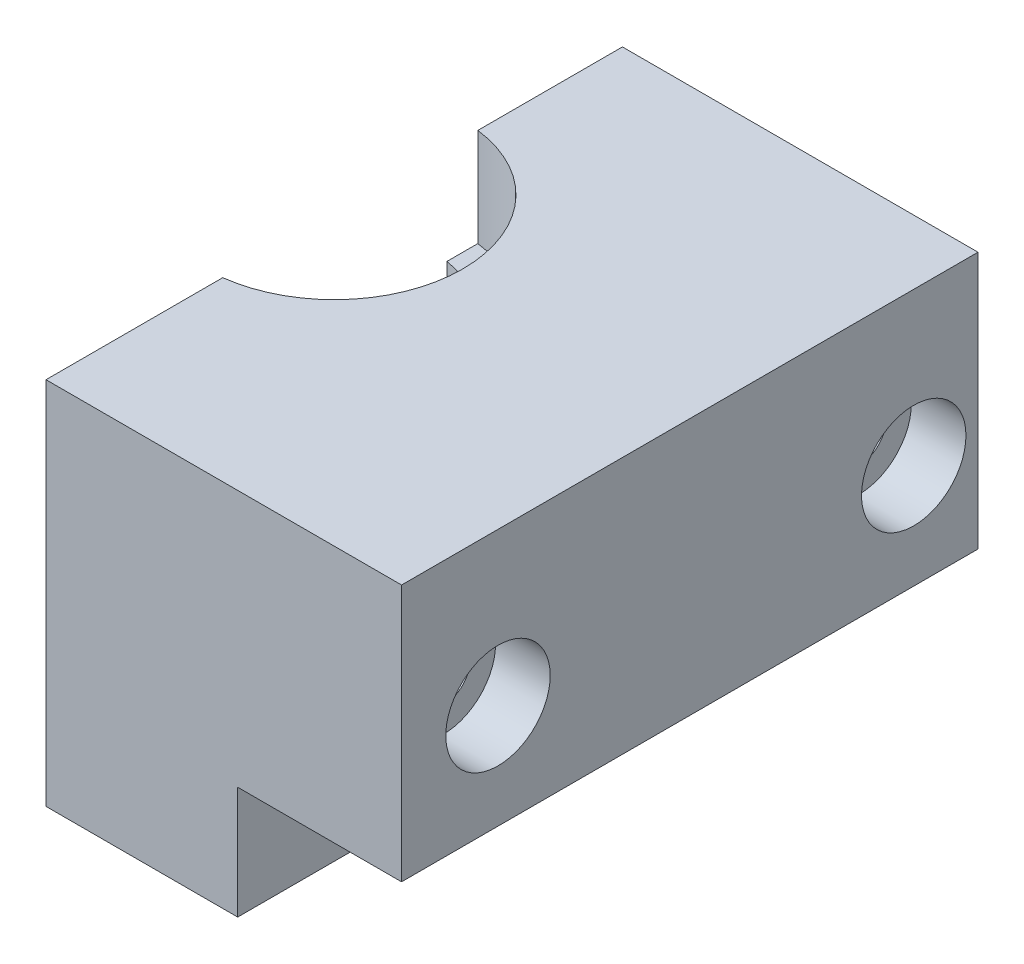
ISO-10303-21;
HEADER;
FILE_DESCRIPTION(('STEP AP214'),'2;1');
FILE_NAME('part.step','',(''),(''),'','','');
FILE_SCHEMA(('AUTOMOTIVE_DESIGN { 1 0 10303 214 1 1 1 1 }'));
ENDSEC;
DATA;
#1=APPLICATION_CONTEXT('core data for automotive mechanical design processes');
#2=APPLICATION_PROTOCOL_DEFINITION('international standard','automotive_design',2000,#1);
#3=PRODUCT_CONTEXT('',#1,'mechanical');
#4=PRODUCT('Part','Part','',(#3));
#5=PRODUCT_RELATED_PRODUCT_CATEGORY('part','',(#4));
#6=PRODUCT_DEFINITION_FORMATION('','',#4);
#7=PRODUCT_DEFINITION_CONTEXT('part definition',#1,'design');
#8=PRODUCT_DEFINITION('design','',#6,#7);
#9=PRODUCT_DEFINITION_SHAPE('','',#8);
#10=(LENGTH_UNIT() NAMED_UNIT(*) SI_UNIT(.MILLI.,.METRE.));
#11=(NAMED_UNIT(*) PLANE_ANGLE_UNIT() SI_UNIT($,.RADIAN.));
#12=(NAMED_UNIT(*) SI_UNIT($,.STERADIAN.) SOLID_ANGLE_UNIT());
#13=UNCERTAINTY_MEASURE_WITH_UNIT(LENGTH_MEASURE(1.E-05),#10,'distance_accuracy_value','');
#14=(GEOMETRIC_REPRESENTATION_CONTEXT(3) GLOBAL_UNCERTAINTY_ASSIGNED_CONTEXT((#13)) GLOBAL_UNIT_ASSIGNED_CONTEXT((#10,
#11,#12)) REPRESENTATION_CONTEXT('',''));
#15=CARTESIAN_POINT('',(0.,0.,0.));
#16=DIRECTION('',(0.,0.,1.));
#17=DIRECTION('',(1.,0.,0.));
#18=AXIS2_PLACEMENT_3D('',#15,#16,#17);
#19=CARTESIAN_POINT('',(-12.065,-11.5,0.));
#20=DIRECTION('',(0.,1.,0.));
#21=DIRECTION('',(0.,0.,1.));
#22=AXIS2_PLACEMENT_3D('',#19,#20,#21);
#23=CYLINDRICAL_SURFACE('',#22,8.);
#24=CARTESIAN_POINT('',(-12.065,-7.5,0.));
#25=DIRECTION('',(0.,-1.,0.));
#26=DIRECTION('',(0.,0.,-1.));
#27=AXIS2_PLACEMENT_3D('',#24,#25,#26);
#28=CIRCLE('',#27,8.);
#29=CARTESIAN_POINT('',(-11.065,-7.5,7.93725393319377));
#30=VERTEX_POINT('',#29);
#31=CARTESIAN_POINT('',(-4.87125271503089,-7.49999999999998,3.50000000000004));
#32=VERTEX_POINT('',#31);
#33=EDGE_CURVE('E68',#30,#32,#28,.F.);
#34=ORIENTED_EDGE('',*,*,#33,.F.);
#35=DIRECTION('',(0.,1.,0.));
#36=VECTOR('',#35,1.);
#37=CARTESIAN_POINT('',(-11.065,-11.5,7.93725393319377));
#38=LINE('',#37,#36);
#39=CARTESIAN_POINT('',(-11.065,-0.299999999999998,7.93725393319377));
#40=VERTEX_POINT('',#39);
#41=EDGE_CURVE('E299',#30,#40,#38,.T.);
#42=ORIENTED_EDGE('',*,*,#41,.T.);
#43=CARTESIAN_POINT('',(-12.065,-0.299999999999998,0.));
#44=DIRECTION('',(0.,-1.,0.));
#45=DIRECTION('',(0.,0.,-1.));
#46=AXIS2_PLACEMENT_3D('',#43,#44,#45);
#47=CIRCLE('',#46,8.);
#48=CARTESIAN_POINT('',(-11.065,-0.299999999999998,-7.93725393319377));
#49=VERTEX_POINT('',#48);
#50=EDGE_CURVE('E344',#49,#40,#47,.T.);
#51=ORIENTED_EDGE('',*,*,#50,.F.);
#52=DIRECTION('',(0.,1.,0.));
#53=VECTOR('',#52,1.);
#54=CARTESIAN_POINT('',(-11.065,-11.5,-7.93725393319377));
#55=LINE('',#54,#53);
#56=CARTESIAN_POINT('',(-11.065,-7.5,-7.93725393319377));
#57=VERTEX_POINT('',#56);
#58=EDGE_CURVE('E291',#49,#57,#55,.F.);
#59=ORIENTED_EDGE('',*,*,#58,.T.);
#60=CARTESIAN_POINT('',(-4.87125271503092,-7.5,-3.50000000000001));
#61=VERTEX_POINT('',#60);
#62=EDGE_CURVE('E225',#61,#57,#28,.F.);
#63=ORIENTED_EDGE('',*,*,#62,.F.);
#64=CARTESIAN_POINT('',(-11.065,-9.84339604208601,-7.93725393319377));
#65=CARTESIAN_POINT('',(-10.8516968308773,-9.82138564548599,-7.91041827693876));
#66=CARTESIAN_POINT('',(-10.6403327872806,-9.79242767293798,-7.87501934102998));
#67=CARTESIAN_POINT('',(-10.2233320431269,-9.72247689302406,-7.7880281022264));
#68=CARTESIAN_POINT('',(-10.0176868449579,-9.68150311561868,-7.73646139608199));
#69=CARTESIAN_POINT('',(-9.61485748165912,-9.58965739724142,-7.61843665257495));
#70=CARTESIAN_POINT('',(-9.41762011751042,-9.53886458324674,-7.55209705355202));
#71=CARTESIAN_POINT('',(-9.03080584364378,-9.42915389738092,-7.405165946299));
#72=CARTESIAN_POINT('',(-8.84123203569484,-9.37023277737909,-7.32456873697));
#73=CARTESIAN_POINT('',(-8.471625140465,-9.24660173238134,-7.15046374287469));
#74=CARTESIAN_POINT('',(-8.29154095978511,-9.1819292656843,-7.05703761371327));
#75=CARTESIAN_POINT('',(-7.94023110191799,-9.04833302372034,-6.85763074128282));
#76=CARTESIAN_POINT('',(-7.76900439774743,-8.97940974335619,-6.75165145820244));
#77=CARTESIAN_POINT('',(-7.26812732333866,-8.76836706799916,-6.41498828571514));
#78=CARTESIAN_POINT('',(-6.95211116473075,-8.62226701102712,-6.1659736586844));
#79=CARTESIAN_POINT('',(-6.48584256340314,-8.39346998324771,-5.73817827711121));
#80=CARTESIAN_POINT('',(-6.32198158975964,-8.31007433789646,-5.57419621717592));
#81=CARTESIAN_POINT('',(-6.00842897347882,-8.14596170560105,-5.23180624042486));
#82=CARTESIAN_POINT('',(-5.85873913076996,-8.06524505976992,-5.05339649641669));
#83=CARTESIAN_POINT('',(-5.57476999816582,-7.90866364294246,-4.68308744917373));
#84=CARTESIAN_POINT('',(-5.44047309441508,-7.83279337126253,-4.49120397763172));
#85=CARTESIAN_POINT('',(-5.18825411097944,-7.68776099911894,-4.09457688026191));
#86=CARTESIAN_POINT('',(-5.07032847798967,-7.61859744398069,-3.88983605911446));
#87=CARTESIAN_POINT('',(-4.87047206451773,-7.49975351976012,-3.50395881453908));
#88=CARTESIAN_POINT('',(-4.78582230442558,-7.44875186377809,-3.32463324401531));
#89=CARTESIAN_POINT('',(-4.62953717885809,-7.35371426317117,-2.95862661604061));
#90=CARTESIAN_POINT('',(-4.55789957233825,-7.30967711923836,-2.77194683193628));
#91=CARTESIAN_POINT('',(-4.42843387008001,-7.22952492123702,-2.39229204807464));
#92=CARTESIAN_POINT('',(-4.37059938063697,-7.19340619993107,-2.19932001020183));
#93=CARTESIAN_POINT('',(-4.26940955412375,-7.12988771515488,-1.80819503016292));
#94=CARTESIAN_POINT('',(-4.22605439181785,-7.10248805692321,-1.6100420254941));
#95=CARTESIAN_POINT('',(-4.15426372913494,-7.05697090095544,-1.20909285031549));
#96=CARTESIAN_POINT('',(-4.12589362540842,-7.03889409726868,-1.00628029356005));
#97=CARTESIAN_POINT('',(-4.08478184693,-7.01266119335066,-0.598433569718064));
#98=CARTESIAN_POINT('',(-4.07204020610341,-7.00450511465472,-0.393399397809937));
#99=CARTESIAN_POINT('',(-4.06238369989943,-6.99832595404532,0.0171741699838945));
#100=CARTESIAN_POINT('',(-4.06546727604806,-7.00030187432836,0.22271351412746));
#101=CARTESIAN_POINT('',(-4.08741001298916,-7.01433340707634,0.632593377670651));
#102=CARTESIAN_POINT('',(-4.10626844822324,-7.02638855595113,0.836933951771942));
#103=CARTESIAN_POINT('',(-4.15754171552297,-7.05903785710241,1.2280690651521));
#104=CARTESIAN_POINT('',(-4.18887741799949,-7.07895135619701,1.41506372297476));
#105=CARTESIAN_POINT('',(-4.26449124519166,-7.12675958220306,1.78544091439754));
#106=CARTESIAN_POINT('',(-4.3087737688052,-7.1546570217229,1.96882219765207));
#107=CARTESIAN_POINT('',(-4.40974986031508,-7.21784607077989,2.33075872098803));
#108=CARTESIAN_POINT('',(-4.46643970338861,-7.2531354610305,2.5093153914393));
#109=CARTESIAN_POINT('',(-4.59166685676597,-7.33043621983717,2.86078964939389));
#110=CARTESIAN_POINT('',(-4.66020871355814,-7.37245016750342,3.03370504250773));
#111=CARTESIAN_POINT('',(-4.81250630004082,-7.46485146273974,3.38222010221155));
#112=CARTESIAN_POINT('',(-4.8968833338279,-7.51556827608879,3.55746126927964));
#113=CARTESIAN_POINT('',(-5.07734653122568,-7.62262483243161,3.90002972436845));
#114=CARTESIAN_POINT('',(-5.17343697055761,-7.67896662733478,4.06735409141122));
#115=CARTESIAN_POINT('',(-5.47828963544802,-7.85495527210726,4.55661815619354));
#116=CARTESIAN_POINT('',(-5.70368782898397,-7.98159930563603,4.86597252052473));
#117=CARTESIAN_POINT('',(-6.08900302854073,-8.1885655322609,5.3230775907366));
#118=CARTESIAN_POINT('',(-6.23597017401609,-8.26566693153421,5.48357898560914));
#119=CARTESIAN_POINT('',(-6.54211922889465,-8.42142482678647,5.79179798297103));
#120=CARTESIAN_POINT('',(-6.70130266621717,-8.50008151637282,5.93951398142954));
#121=CARTESIAN_POINT('',(-7.03136555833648,-8.65719639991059,6.22171507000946));
#122=CARTESIAN_POINT('',(-7.20225624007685,-8.73565432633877,6.3561871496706));
#123=CARTESIAN_POINT('',(-7.55507178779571,-8.89036663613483,6.61119578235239));
#124=CARTESIAN_POINT('',(-7.73699552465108,-8.96662124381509,6.73173375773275));
#125=CARTESIAN_POINT('',(-8.09648191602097,-9.10894092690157,6.94920247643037));
#126=CARTESIAN_POINT('',(-8.27324003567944,-9.17533400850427,7.04724842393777));
#127=CARTESIAN_POINT('',(-8.63527823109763,-9.30273142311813,7.2303634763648));
#128=CARTESIAN_POINT('',(-8.82055928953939,-9.36373513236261,7.31543107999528));
#129=CARTESIAN_POINT('',(-9.19843098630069,-9.47827787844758,7.47157539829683));
#130=CARTESIAN_POINT('',(-9.39099646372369,-9.53184007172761,7.54269581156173));
#131=CARTESIAN_POINT('',(-9.78306774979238,-9.62978047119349,7.670413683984));
#132=CARTESIAN_POINT('',(-9.98256906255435,-9.67416450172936,7.7270203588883));
#133=CARTESIAN_POINT('',(-10.3290238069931,-9.74071506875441,7.81078422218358));
#134=CARTESIAN_POINT('',(-10.4745496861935,-9.76559810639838,7.8417269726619));
#135=CARTESIAN_POINT('',(-10.7680765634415,-9.80923967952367,7.89558769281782));
#136=CARTESIAN_POINT('',(-10.9160790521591,-9.82799437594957,7.91850063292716));
#137=CARTESIAN_POINT('',(-11.065,-9.84339604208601,7.93725393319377));
#138=B_SPLINE_CURVE_WITH_KNOTS('',3,(#64,#65,#66,#67,#68,#69,#70,#71,#72,#73,#74,#75,#76,#77,
#78,#79,#80,#81,#82,#83,#84,#85,#86,#87,#88,#89,#90,#91,#92,#93,#94,#95,#96,#97,#98,#99,#100,
#101,#102,#103,#104,#105,#106,#107,#108,#109,#110,#111,#112,#113,#114,#115,#116,#117,#118,#119,
#120,#121,#122,#123,#124,#125,#126,#127,#128,#129,#130,#131,#132,#133,#134,#135,#136,#137),
.UNSPECIFIED.,.F.,.F.,(4,2,2,2,2,2,2,2,2,2,2,2,2,2,2,2,2,2,2,2,2,2,2,2,2,2,2,2,2,2,2,2,2,2,2,2,
4),(0.,0.647832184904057,1.29464385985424,1.93644549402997,2.57850434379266,3.2166511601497,
3.85472381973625,5.1337389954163,5.87217106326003,6.61069679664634,7.34836882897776,
8.0858805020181,8.69952634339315,9.31306639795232,9.92632170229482,10.5395844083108,
11.1555018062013,11.7714205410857,12.3872786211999,13.0031083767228,13.5743976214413,
14.1458811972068,14.7171934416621,15.2887253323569,15.8910923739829,16.4936799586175,
17.6984408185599,18.3905405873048,19.0827270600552,19.7755868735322,20.4683758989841,
21.1060476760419,21.7437931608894,22.3795073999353,23.0148169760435,23.4670158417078,
23.9194974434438),.UNSPECIFIED.);
#139=EDGE_CURVE('E243',#61,#32,#138,.T.);
#140=ORIENTED_EDGE('',*,*,#139,.T.);
#141=EDGE_LOOP('',(#34,#42,#51,#59,#63,#140));
#142=FACE_BOUND('',#141,.T.);
#143=ADVANCED_FACE('F38',(#142),#23,.F.);
#144=CARTESIAN_POINT('',(11.065,-11.5,17.9375));
#145=DIRECTION('',(0.,1.,0.));
#146=DIRECTION('',(0.,0.,1.));
#147=AXIS2_PLACEMENT_3D('',#144,#145,#146);
#148=PLANE('',#147);
#149=DIRECTION('',(0.,0.,-1.));
#150=VECTOR('',#149,1.);
#151=CARTESIAN_POINT('',(-11.065,-11.5,17.9375));
#152=LINE('',#151,#150);
#153=CARTESIAN_POINT('',(-11.065,-11.5,18.9375));
#154=VERTEX_POINT('',#153);
#155=CARTESIAN_POINT('',(-11.065,-11.5,11.4564392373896));
#156=VERTEX_POINT('',#155);
#157=EDGE_CURVE('E309',#154,#156,#152,.T.);
#158=ORIENTED_EDGE('',*,*,#157,.T.);
#159=CARTESIAN_POINT('',(-12.065,-11.5,0.));
#160=DIRECTION('',(0.,-1.,0.));
#161=DIRECTION('',(0.,0.,-1.));
#162=AXIS2_PLACEMENT_3D('',#159,#160,#161);
#163=CIRCLE('',#162,11.5);
#164=CARTESIAN_POINT('',(-5.74044467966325,-11.5,9.60468635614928));
#165=VERTEX_POINT('',#164);
#166=EDGE_CURVE('E215',#165,#156,#163,.T.);
#167=ORIENTED_EDGE('',*,*,#166,.F.);
#168=DIRECTION('',(1.,0.,0.));
#169=VECTOR('',#168,1.);
#170=CARTESIAN_POINT('',(-11.065,-11.5,9.60468635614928));
#171=LINE('',#170,#169);
#172=CARTESIAN_POINT('',(0.865000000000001,-11.5,9.60468635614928));
#173=VERTEX_POINT('',#172);
#174=EDGE_CURVE('E431',#165,#173,#171,.T.);
#175=ORIENTED_EDGE('',*,*,#174,.T.);
#176=DIRECTION('',(0.,0.,-1.));
#177=VECTOR('',#176,1.);
#178=CARTESIAN_POINT('',(0.865000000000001,-11.5,17.9375));
#179=LINE('',#178,#177);
#180=CARTESIAN_POINT('',(0.865000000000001,-11.5,18.9375));
#181=VERTEX_POINT('',#180);
#182=EDGE_CURVE('E183',#181,#173,#179,.T.);
#183=ORIENTED_EDGE('',*,*,#182,.F.);
#184=DIRECTION('',(1.,0.,0.));
#185=VECTOR('',#184,1.);
#186=CARTESIAN_POINT('',(-11.065,-11.5,18.9375));
#187=LINE('',#186,#185);
#188=EDGE_CURVE('E199',#154,#181,#187,.T.);
#189=ORIENTED_EDGE('',*,*,#188,.F.);
#190=EDGE_LOOP('',(#158,#167,#175,#183,#189));
#191=FACE_BOUND('',#190,.T.);
#192=ADVANCED_FACE('F445',(#191),#148,.F.);
#193=CARTESIAN_POINT('',(11.065,0.,0.));
#194=DIRECTION('',(-1.,0.,0.));
#195=DIRECTION('',(0.,0.,1.));
#196=AXIS2_PLACEMENT_3D('',#193,#194,#195);
#197=PLANE('',#196);
#198=CARTESIAN_POINT('',(11.065,2.,12.9375));
#199=DIRECTION('',(1.,0.,0.));
#200=DIRECTION('',(0.,0.,-1.));
#201=AXIS2_PLACEMENT_3D('',#198,#199,#200);
#202=CIRCLE('',#201,3.25);
#203=CARTESIAN_POINT('',(11.065,2.,9.68750000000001));
#204=VERTEX_POINT('',#203);
#205=EDGE_CURVE('E428',#204,#204,#202,.T.);
#206=ORIENTED_EDGE('',*,*,#205,.F.);
#207=EDGE_LOOP('',(#206));
#208=FACE_BOUND('',#207,.T.);
#209=CARTESIAN_POINT('',(11.065,2.,-12.9375));
#210=DIRECTION('',(1.,0.,0.));
#211=DIRECTION('',(0.,0.,-1.));
#212=AXIS2_PLACEMENT_3D('',#209,#210,#211);
#213=CIRCLE('',#212,3.25);
#214=CARTESIAN_POINT('',(11.065,2.,-16.1875));
#215=VERTEX_POINT('',#214);
#216=EDGE_CURVE('E412',#215,#215,#213,.T.);
#217=ORIENTED_EDGE('',*,*,#216,.F.);
#218=EDGE_LOOP('',(#217));
#219=FACE_BOUND('',#218,.T.);
#220=DIRECTION('',(0.,0.,1.));
#221=VECTOR('',#220,1.);
#222=CARTESIAN_POINT('',(11.065,11.5,17.9375));
#223=LINE('',#222,#221);
#224=CARTESIAN_POINT('',(11.065,11.5,-16.9375));
#225=VERTEX_POINT('',#224);
#226=CARTESIAN_POINT('',(11.065,11.5,18.9375));
#227=VERTEX_POINT('',#226);
#228=EDGE_CURVE('E313',#225,#227,#223,.T.);
#229=ORIENTED_EDGE('',*,*,#228,.T.);
#230=DIRECTION('',(0.,1.,0.));
#231=VECTOR('',#230,1.);
#232=CARTESIAN_POINT('',(11.065,-4.5,18.9375));
#233=LINE('',#232,#231);
#234=CARTESIAN_POINT('',(11.065,-4.5,18.9375));
#235=VERTEX_POINT('',#234);
#236=EDGE_CURVE('E193',#235,#227,#233,.T.);
#237=ORIENTED_EDGE('',*,*,#236,.F.);
#238=DIRECTION('',(0.,0.,1.));
#239=VECTOR('',#238,1.);
#240=CARTESIAN_POINT('',(11.065,-4.5,17.9375));
#241=LINE('',#240,#239);
#242=CARTESIAN_POINT('',(11.065,-4.5,-16.9375));
#243=VERTEX_POINT('',#242);
#244=EDGE_CURVE('E182',#243,#235,#241,.T.);
#245=ORIENTED_EDGE('',*,*,#244,.F.);
#246=DIRECTION('',(0.,-1.,0.));
#247=VECTOR('',#246,1.);
#248=CARTESIAN_POINT('',(11.065,11.5,-16.9375));
#249=LINE('',#248,#247);
#250=EDGE_CURVE('E394',#225,#243,#249,.T.);
#251=ORIENTED_EDGE('',*,*,#250,.F.);
#252=EDGE_LOOP('',(#229,#237,#245,#251));
#253=FACE_BOUND('',#252,.T.);
#254=ADVANCED_FACE('F535',(#208,#219,#253),#197,.F.);
#255=CARTESIAN_POINT('',(-12.065,5.4,0.));
#256=DIRECTION('',(0.,-1.,0.));
#257=DIRECTION('',(0.,0.,-1.));
#258=AXIS2_PLACEMENT_3D('',#255,#256,#257);
#259=CIRCLE('',#258,8.);
#260=CARTESIAN_POINT('',(-11.065,5.4,-7.93725393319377));
#261=VERTEX_POINT('',#260);
#262=CARTESIAN_POINT('',(-11.065,5.4,7.93725393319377));
#263=VERTEX_POINT('',#262);
#264=EDGE_CURVE('E335',#261,#263,#259,.T.);
#265=ORIENTED_EDGE('',*,*,#264,.T.);
#266=CARTESIAN_POINT('',(-11.065,11.5,7.93725393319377));
#267=VERTEX_POINT('',#266);
#268=EDGE_CURVE('E302',#263,#267,#38,.T.);
#269=ORIENTED_EDGE('',*,*,#268,.T.);
#270=CARTESIAN_POINT('',(-12.065,11.5,0.));
#271=DIRECTION('',(0.,1.,0.));
#272=DIRECTION('',(0.,0.,1.));
#273=AXIS2_PLACEMENT_3D('',#270,#271,#272);
#274=CIRCLE('',#273,8.);
#275=CARTESIAN_POINT('',(-11.065,11.5,-7.93725393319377));
#276=VERTEX_POINT('',#275);
#277=EDGE_CURVE('E321',#267,#276,#274,.T.);
#278=ORIENTED_EDGE('',*,*,#277,.T.);
#279=EDGE_CURVE('E305',#276,#261,#55,.F.);
#280=ORIENTED_EDGE('',*,*,#279,.T.);
#281=EDGE_LOOP('',(#265,#269,#278,#280));
#282=FACE_BOUND('',#281,.T.);
#283=ADVANCED_FACE('F505',(#282),#23,.F.);
#284=CARTESIAN_POINT('',(-11.065,0.,0.));
#285=DIRECTION('',(-1.,0.,0.));
#286=DIRECTION('',(0.,0.,1.));
#287=AXIS2_PLACEMENT_3D('',#284,#285,#286);
#288=PLANE('',#287);
#289=DIRECTION('',(0.,-1.,0.));
#290=VECTOR('',#289,1.);
#291=CARTESIAN_POINT('',(-11.065,-7.5,11.4564392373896));
#292=LINE('',#291,#290);
#293=CARTESIAN_POINT('',(-11.065,-7.5,11.4564392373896));
#294=VERTEX_POINT('',#293);
#295=EDGE_CURVE('E236',#156,#294,#292,.F.);
#296=ORIENTED_EDGE('',*,*,#295,.F.);
#297=ORIENTED_EDGE('',*,*,#157,.F.);
#298=DIRECTION('',(0.,-1.,0.));
#299=VECTOR('',#298,1.);
#300=CARTESIAN_POINT('',(-11.065,11.5,18.9375));
#301=LINE('',#300,#299);
#302=CARTESIAN_POINT('',(-11.065,11.5,18.9375));
#303=VERTEX_POINT('',#302);
#304=EDGE_CURVE('E210',#303,#154,#301,.T.);
#305=ORIENTED_EDGE('',*,*,#304,.F.);
#306=DIRECTION('',(0.,0.,1.));
#307=VECTOR('',#306,1.);
#308=CARTESIAN_POINT('',(-11.065,11.5,17.9375));
#309=LINE('',#308,#307);
#310=EDGE_CURVE('E318',#267,#303,#309,.T.);
#311=ORIENTED_EDGE('',*,*,#310,.F.);
#312=ORIENTED_EDGE('',*,*,#268,.F.);
#313=DIRECTION('',(0.,0.,-1.));
#314=VECTOR('',#313,1.);
#315=CARTESIAN_POINT('',(-11.065,5.4,7.93725393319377));
#316=LINE('',#315,#314);
#317=CARTESIAN_POINT('',(-11.065,5.4,6.01747455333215));
#318=VERTEX_POINT('',#317);
#319=EDGE_CURVE('E355',#263,#318,#316,.T.);
#320=ORIENTED_EDGE('',*,*,#319,.T.);
#321=DIRECTION('',(0.,-1.,0.));
#322=VECTOR('',#321,1.);
#323=CARTESIAN_POINT('',(-11.065,5.4,6.01747455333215));
#324=LINE('',#323,#322);
#325=CARTESIAN_POINT('',(-11.065,-0.299999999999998,6.01747455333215));
#326=VERTEX_POINT('',#325);
#327=EDGE_CURVE('E326',#318,#326,#324,.T.);
#328=ORIENTED_EDGE('',*,*,#327,.T.);
#329=DIRECTION('',(0.,0.,-1.));
#330=VECTOR('',#329,1.);
#331=CARTESIAN_POINT('',(-11.065,-0.299999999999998,7.93725393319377));
#332=LINE('',#331,#330);
#333=EDGE_CURVE('E340',#40,#326,#332,.T.);
#334=ORIENTED_EDGE('',*,*,#333,.F.);
#335=ORIENTED_EDGE('',*,*,#41,.F.);
#336=DIRECTION('',(0.,0.,1.));
#337=VECTOR('',#336,1.);
#338=CARTESIAN_POINT('',(-11.065,-7.5,0.));
#339=LINE('',#338,#337);
#340=EDGE_CURVE('E224',#30,#294,#339,.T.);
#341=ORIENTED_EDGE('',*,*,#340,.T.);
#342=EDGE_LOOP('',(#296,#297,#305,#311,#312,#320,#328,#334,#335,#341));
#343=FACE_BOUND('',#342,.T.);
#344=CARTESIAN_POINT('',(-11.065,2.,12.9375));
#345=DIRECTION('',(1.,0.,0.));
#346=DIRECTION('',(0.,0.,-1.));
#347=AXIS2_PLACEMENT_3D('',#344,#345,#346);
#348=CIRCLE('',#347,1.69999999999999);
#349=CARTESIAN_POINT('',(-11.065,2.,11.2375));
#350=VERTEX_POINT('',#349);
#351=EDGE_CURVE('E416',#350,#350,#348,.T.);
#352=ORIENTED_EDGE('',*,*,#351,.T.);
#353=EDGE_LOOP('',(#352));
#354=FACE_BOUND('',#353,.T.);
#355=ADVANCED_FACE('F449',(#343,#354),#288,.T.);
#356=CARTESIAN_POINT('',(11.065,11.5,17.9375));
#357=DIRECTION('',(0.,-1.,0.));
#358=DIRECTION('',(0.,0.,-1.));
#359=AXIS2_PLACEMENT_3D('',#356,#357,#358);
#360=PLANE('',#359);
#361=ORIENTED_EDGE('',*,*,#310,.T.);
#362=DIRECTION('',(-1.,0.,0.));
#363=VECTOR('',#362,1.);
#364=CARTESIAN_POINT('',(11.065,11.5,18.9375));
#365=LINE('',#364,#363);
#366=EDGE_CURVE('E206',#227,#303,#365,.T.);
#367=ORIENTED_EDGE('',*,*,#366,.F.);
#368=ORIENTED_EDGE('',*,*,#228,.F.);
#369=DIRECTION('',(1.,0.,0.));
#370=VECTOR('',#369,1.);
#371=CARTESIAN_POINT('',(-11.065,11.5,-16.9375));
#372=LINE('',#371,#370);
#373=CARTESIAN_POINT('',(-11.065,11.5,-16.9375));
#374=VERTEX_POINT('',#373);
#375=EDGE_CURVE('E387',#374,#225,#372,.T.);
#376=ORIENTED_EDGE('',*,*,#375,.F.);
#377=EDGE_CURVE('E315',#374,#276,#309,.T.);
#378=ORIENTED_EDGE('',*,*,#377,.T.);
#379=ORIENTED_EDGE('',*,*,#277,.F.);
#380=EDGE_LOOP('',(#361,#367,#368,#376,#378,#379));
#381=FACE_BOUND('',#380,.T.);
#382=ADVANCED_FACE('F40',(#381),#360,.F.);
#383=DIRECTION('',(1.,0.,0.));
#384=VECTOR('',#383,1.);
#385=CARTESIAN_POINT('',(-11.065,-11.5,-9.60468635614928));
#386=LINE('',#385,#384);
#387=CARTESIAN_POINT('',(0.865000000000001,-11.5,-9.60468635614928));
#388=VERTEX_POINT('',#387);
#389=CARTESIAN_POINT('',(-5.74044467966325,-11.5,-9.60468635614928));
#390=VERTEX_POINT('',#389);
#391=EDGE_CURVE('E252',#388,#390,#386,.F.);
#392=ORIENTED_EDGE('',*,*,#391,.T.);
#393=CARTESIAN_POINT('',(-11.065,-11.5,-11.4564392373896));
#394=VERTEX_POINT('',#393);
#395=EDGE_CURVE('E219',#394,#390,#163,.T.);
#396=ORIENTED_EDGE('',*,*,#395,.F.);
#397=CARTESIAN_POINT('',(-11.065,-11.5,-16.9375));
#398=VERTEX_POINT('',#397);
#399=EDGE_CURVE('E314',#394,#398,#152,.T.);
#400=ORIENTED_EDGE('',*,*,#399,.T.);
#401=DIRECTION('',(1.,0.,0.));
#402=VECTOR('',#401,1.);
#403=CARTESIAN_POINT('',(-11.065,-11.5,-16.9375));
#404=LINE('',#403,#402);
#405=CARTESIAN_POINT('',(0.865000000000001,-11.5,-16.9375));
#406=VERTEX_POINT('',#405);
#407=EDGE_CURVE('E386',#398,#406,#404,.T.);
#408=ORIENTED_EDGE('',*,*,#407,.T.);
#409=EDGE_CURVE('E364',#388,#406,#179,.T.);
#410=ORIENTED_EDGE('',*,*,#409,.F.);
#411=EDGE_LOOP('',(#392,#396,#400,#408,#410));
#412=FACE_BOUND('',#411,.T.);
#413=ADVANCED_FACE('F442',(#412),#148,.F.);
#414=DIRECTION('',(0.,-1.,0.));
#415=VECTOR('',#414,1.);
#416=CARTESIAN_POINT('',(-11.065,-7.5,-11.4564392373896));
#417=LINE('',#416,#415);
#418=CARTESIAN_POINT('',(-11.065,-7.5,-11.4564392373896));
#419=VERTEX_POINT('',#418);
#420=EDGE_CURVE('E233',#419,#394,#417,.T.);
#421=ORIENTED_EDGE('',*,*,#420,.F.);
#422=DIRECTION('',(0.,0.,1.));
#423=VECTOR('',#422,1.);
#424=CARTESIAN_POINT('',(-11.065,-7.5,0.));
#425=LINE('',#424,#423);
#426=EDGE_CURVE('E229',#419,#57,#425,.T.);
#427=ORIENTED_EDGE('',*,*,#426,.T.);
#428=ORIENTED_EDGE('',*,*,#58,.F.);
#429=DIRECTION('',(0.,0.,-1.));
#430=VECTOR('',#429,1.);
#431=CARTESIAN_POINT('',(-11.065,-0.299999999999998,-6.01747455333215));
#432=LINE('',#431,#430);
#433=CARTESIAN_POINT('',(-11.065,-0.299999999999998,-6.01747455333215));
#434=VERTEX_POINT('',#433);
#435=EDGE_CURVE('E332',#434,#49,#432,.T.);
#436=ORIENTED_EDGE('',*,*,#435,.F.);
#437=DIRECTION('',(0.,-1.,0.));
#438=VECTOR('',#437,1.);
#439=CARTESIAN_POINT('',(-11.065,5.4,-6.01747455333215));
#440=LINE('',#439,#438);
#441=CARTESIAN_POINT('',(-11.065,5.4,-6.01747455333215));
#442=VERTEX_POINT('',#441);
#443=EDGE_CURVE('E325',#442,#434,#440,.T.);
#444=ORIENTED_EDGE('',*,*,#443,.F.);
#445=DIRECTION('',(0.,0.,-1.));
#446=VECTOR('',#445,1.);
#447=CARTESIAN_POINT('',(-11.065,5.4,-6.01747455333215));
#448=LINE('',#447,#446);
#449=EDGE_CURVE('E329',#442,#261,#448,.T.);
#450=ORIENTED_EDGE('',*,*,#449,.T.);
#451=ORIENTED_EDGE('',*,*,#279,.F.);
#452=ORIENTED_EDGE('',*,*,#377,.F.);
#453=DIRECTION('',(0.,-1.,0.));
#454=VECTOR('',#453,1.);
#455=CARTESIAN_POINT('',(-11.065,11.5,-16.9375));
#456=LINE('',#455,#454);
#457=EDGE_CURVE('E390',#374,#398,#456,.T.);
#458=ORIENTED_EDGE('',*,*,#457,.T.);
#459=ORIENTED_EDGE('',*,*,#399,.F.);
#460=EDGE_LOOP('',(#421,#427,#428,#436,#444,#450,#451,#452,#458,#459));
#461=FACE_BOUND('',#460,.T.);
#462=CARTESIAN_POINT('',(-11.065,2.,-12.9375));
#463=DIRECTION('',(1.,0.,0.));
#464=DIRECTION('',(0.,0.,-1.));
#465=AXIS2_PLACEMENT_3D('',#462,#463,#464);
#466=CIRCLE('',#465,1.69999999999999);
#467=CARTESIAN_POINT('',(-11.065,2.,-14.6375));
#468=VERTEX_POINT('',#467);
#469=EDGE_CURVE('E397',#468,#468,#466,.T.);
#470=ORIENTED_EDGE('',*,*,#469,.T.);
#471=EDGE_LOOP('',(#470));
#472=FACE_BOUND('',#471,.T.);
#473=ADVANCED_FACE('F521',(#461,#472),#288,.T.);
#474=CARTESIAN_POINT('',(-12.065,5.4,0.));
#475=DIRECTION('',(0.,-1.,0.));
#476=DIRECTION('',(0.,0.,-1.));
#477=AXIS2_PLACEMENT_3D('',#474,#475,#476);
#478=CYLINDRICAL_SURFACE('',#477,6.1);
#479=CARTESIAN_POINT('',(-12.065,-0.299999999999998,0.));
#480=DIRECTION('',(0.,1.,0.));
#481=DIRECTION('',(0.,0.,-1.));
#482=AXIS2_PLACEMENT_3D('',#479,#480,#481);
#483=CIRCLE('',#482,6.1);
#484=EDGE_CURVE('E336',#326,#434,#483,.T.);
#485=ORIENTED_EDGE('',*,*,#484,.F.);
#486=ORIENTED_EDGE('',*,*,#327,.F.);
#487=CARTESIAN_POINT('',(-12.065,5.4,0.));
#488=DIRECTION('',(0.,1.,0.));
#489=DIRECTION('',(0.,0.,-1.));
#490=AXIS2_PLACEMENT_3D('',#487,#488,#489);
#491=CIRCLE('',#490,6.1);
#492=EDGE_CURVE('E351',#318,#442,#491,.T.);
#493=ORIENTED_EDGE('',*,*,#492,.T.);
#494=ORIENTED_EDGE('',*,*,#443,.T.);
#495=EDGE_LOOP('',(#485,#486,#493,#494));
#496=FACE_BOUND('',#495,.T.);
#497=ADVANCED_FACE('F514',(#496),#478,.F.);
#498=CARTESIAN_POINT('',(-12.065,5.4,0.));
#499=DIRECTION('',(0.,-1.,0.));
#500=DIRECTION('',(0.,0.,-1.));
#501=AXIS2_PLACEMENT_3D('',#498,#499,#500);
#502=PLANE('',#501);
#503=ORIENTED_EDGE('',*,*,#264,.F.);
#504=ORIENTED_EDGE('',*,*,#449,.F.);
#505=ORIENTED_EDGE('',*,*,#492,.F.);
#506=ORIENTED_EDGE('',*,*,#319,.F.);
#507=EDGE_LOOP('',(#503,#504,#505,#506));
#508=FACE_BOUND('',#507,.T.);
#509=ADVANCED_FACE('F511',(#508),#502,.F.);
#510=CARTESIAN_POINT('',(-12.065,-0.299999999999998,0.));
#511=DIRECTION('',(0.,-1.,0.));
#512=DIRECTION('',(0.,0.,-1.));
#513=AXIS2_PLACEMENT_3D('',#510,#511,#512);
#514=PLANE('',#513);
#515=ORIENTED_EDGE('',*,*,#50,.T.);
#516=ORIENTED_EDGE('',*,*,#333,.T.);
#517=ORIENTED_EDGE('',*,*,#484,.T.);
#518=ORIENTED_EDGE('',*,*,#435,.T.);
#519=EDGE_LOOP('',(#515,#516,#517,#518));
#520=FACE_BOUND('',#519,.T.);
#521=ADVANCED_FACE('F517',(#520),#514,.T.);
#522=CARTESIAN_POINT('',(11.065,-4.5,17.9375));
#523=DIRECTION('',(0.,-1.,0.));
#524=DIRECTION('',(0.,0.,-1.));
#525=AXIS2_PLACEMENT_3D('',#522,#523,#524);
#526=PLANE('',#525);
#527=ORIENTED_EDGE('',*,*,#244,.T.);
#528=DIRECTION('',(1.,0.,0.));
#529=VECTOR('',#528,1.);
#530=CARTESIAN_POINT('',(0.865000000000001,-4.5,18.9375));
#531=LINE('',#530,#529);
#532=CARTESIAN_POINT('',(0.865000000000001,-4.5,18.9375));
#533=VERTEX_POINT('',#532);
#534=EDGE_CURVE('E186',#533,#235,#531,.T.);
#535=ORIENTED_EDGE('',*,*,#534,.F.);
#536=DIRECTION('',(0.,0.,1.));
#537=VECTOR('',#536,1.);
#538=CARTESIAN_POINT('',(0.865000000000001,-4.5,17.9375));
#539=LINE('',#538,#537);
#540=CARTESIAN_POINT('',(0.865000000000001,-4.5,-16.9375));
#541=VERTEX_POINT('',#540);
#542=EDGE_CURVE('E171',#541,#533,#539,.T.);
#543=ORIENTED_EDGE('',*,*,#542,.F.);
#544=DIRECTION('',(-1.,0.,0.));
#545=VECTOR('',#544,1.);
#546=CARTESIAN_POINT('',(11.065,-4.5,-16.9375));
#547=LINE('',#546,#545);
#548=EDGE_CURVE('E383',#243,#541,#547,.T.);
#549=ORIENTED_EDGE('',*,*,#548,.F.);
#550=EDGE_LOOP('',(#527,#535,#543,#549));
#551=FACE_BOUND('',#550,.T.);
#552=ADVANCED_FACE('F187',(#551),#526,.T.);
#553=CARTESIAN_POINT('',(0.865000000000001,0.,0.));
#554=DIRECTION('',(-1.,0.,0.));
#555=DIRECTION('',(0.,0.,1.));
#556=AXIS2_PLACEMENT_3D('',#553,#554,#555);
#557=PLANE('',#556);
#558=CARTESIAN_POINT('',(0.865000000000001,-7.5,12.));
#559=DIRECTION('',(1.,0.,0.));
#560=DIRECTION('',(0.,0.,-1.));
#561=AXIS2_PLACEMENT_3D('',#558,#559,#560);
#562=CIRCLE('',#561,2.);
#563=CARTESIAN_POINT('',(0.865000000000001,-7.5,10.));
#564=VERTEX_POINT('',#563);
#565=EDGE_CURVE('E379',#564,#564,#562,.T.);
#566=ORIENTED_EDGE('',*,*,#565,.F.);
#567=EDGE_LOOP('',(#566));
#568=FACE_BOUND('',#567,.T.);
#569=CARTESIAN_POINT('',(0.865000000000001,-7.5,-12.));
#570=DIRECTION('',(1.,0.,0.));
#571=DIRECTION('',(0.,0.,-1.));
#572=AXIS2_PLACEMENT_3D('',#569,#570,#571);
#573=CIRCLE('',#572,2.);
#574=CARTESIAN_POINT('',(0.865000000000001,-7.5,-14.));
#575=VERTEX_POINT('',#574);
#576=EDGE_CURVE('E371',#575,#575,#573,.T.);
#577=ORIENTED_EDGE('',*,*,#576,.F.);
#578=EDGE_LOOP('',(#577));
#579=FACE_BOUND('',#578,.T.);
#580=ORIENTED_EDGE('',*,*,#182,.T.);
#581=CARTESIAN_POINT('',(0.865000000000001,-19.5,0.));
#582=DIRECTION('',(1.,0.,0.));
#583=DIRECTION('',(0.,0.,-1.));
#584=AXIS2_PLACEMENT_3D('',#581,#582,#583);
#585=CIRCLE('',#584,12.5);
#586=EDGE_CURVE('E239',#388,#173,#585,.T.);
#587=ORIENTED_EDGE('',*,*,#586,.F.);
#588=ORIENTED_EDGE('',*,*,#409,.T.);
#589=DIRECTION('',(0.,1.,0.));
#590=VECTOR('',#589,1.);
#591=CARTESIAN_POINT('',(0.865000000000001,0.,-16.9375));
#592=LINE('',#591,#590);
#593=EDGE_CURVE('E178',#406,#541,#592,.T.);
#594=ORIENTED_EDGE('',*,*,#593,.T.);
#595=ORIENTED_EDGE('',*,*,#542,.T.);
#596=DIRECTION('',(0.,1.,0.));
#597=VECTOR('',#596,1.);
#598=CARTESIAN_POINT('',(0.865000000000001,-11.5,18.9375));
#599=LINE('',#598,#597);
#600=EDGE_CURVE('E176',#181,#533,#599,.T.);
#601=ORIENTED_EDGE('',*,*,#600,.F.);
#602=EDGE_LOOP('',(#580,#587,#588,#594,#595,#601));
#603=FACE_BOUND('',#602,.T.);
#604=ADVANCED_FACE('F174',(#568,#579,#603),#557,.F.);
#605=CARTESIAN_POINT('',(-6.135,-7.5,-12.));
#606=DIRECTION('',(-1.,0.,0.));
#607=DIRECTION('',(0.,0.,1.));
#608=AXIS2_PLACEMENT_3D('',#605,#606,#607);
#609=PLANE('',#608);
#610=CARTESIAN_POINT('',(-6.135,-7.5,-12.));
#611=DIRECTION('',(1.,0.,0.));
#612=DIRECTION('',(0.,0.,-1.));
#613=AXIS2_PLACEMENT_3D('',#610,#611,#612);
#614=CIRCLE('',#613,2.);
#615=CARTESIAN_POINT('',(-6.135,-7.5,-14.));
#616=VERTEX_POINT('',#615);
#617=EDGE_CURVE('E367',#616,#616,#614,.T.);
#618=ORIENTED_EDGE('',*,*,#617,.T.);
#619=EDGE_LOOP('',(#618));
#620=FACE_BOUND('',#619,.T.);
#621=ADVANCED_FACE('F659',(#620),#609,.F.);
#622=CARTESIAN_POINT('',(0.865000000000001,-7.5,-12.));
#623=DIRECTION('',(1.,0.,0.));
#624=DIRECTION('',(0.,0.,-1.));
#625=AXIS2_PLACEMENT_3D('',#622,#623,#624);
#626=CYLINDRICAL_SURFACE('',#625,2.);
#627=ORIENTED_EDGE('',*,*,#617,.F.);
#628=EDGE_LOOP('',(#627));
#629=FACE_BOUND('',#628,.T.);
#630=ORIENTED_EDGE('',*,*,#576,.T.);
#631=EDGE_LOOP('',(#630));
#632=FACE_BOUND('',#631,.T.);
#633=ADVANCED_FACE('F777',(#629,#632),#626,.F.);
#634=CARTESIAN_POINT('',(-6.135,-7.5,12.));
#635=DIRECTION('',(-1.,0.,0.));
#636=DIRECTION('',(0.,0.,1.));
#637=AXIS2_PLACEMENT_3D('',#634,#635,#636);
#638=PLANE('',#637);
#639=CARTESIAN_POINT('',(-6.135,-7.5,12.));
#640=DIRECTION('',(1.,0.,0.));
#641=DIRECTION('',(0.,0.,-1.));
#642=AXIS2_PLACEMENT_3D('',#639,#640,#641);
#643=CIRCLE('',#642,2.);
#644=CARTESIAN_POINT('',(-6.135,-7.5,10.));
#645=VERTEX_POINT('',#644);
#646=EDGE_CURVE('E375',#645,#645,#643,.T.);
#647=ORIENTED_EDGE('',*,*,#646,.T.);
#648=EDGE_LOOP('',(#647));
#649=FACE_BOUND('',#648,.T.);
#650=ADVANCED_FACE('F767',(#649),#638,.F.);
#651=CARTESIAN_POINT('',(0.865000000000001,-7.5,12.));
#652=DIRECTION('',(1.,0.,0.));
#653=DIRECTION('',(0.,0.,-1.));
#654=AXIS2_PLACEMENT_3D('',#651,#652,#653);
#655=CYLINDRICAL_SURFACE('',#654,2.);
#656=ORIENTED_EDGE('',*,*,#646,.F.);
#657=EDGE_LOOP('',(#656));
#658=FACE_BOUND('',#657,.T.);
#659=ORIENTED_EDGE('',*,*,#565,.T.);
#660=EDGE_LOOP('',(#659));
#661=FACE_BOUND('',#660,.T.);
#662=ADVANCED_FACE('F757',(#658,#661),#655,.F.);
#663=CARTESIAN_POINT('',(-11.065,11.5,-16.9375));
#664=DIRECTION('',(0.,0.,1.));
#665=DIRECTION('',(1.,0.,0.));
#666=AXIS2_PLACEMENT_3D('',#663,#664,#665);
#667=PLANE('',#666);
#668=ORIENTED_EDGE('',*,*,#548,.T.);
#669=ORIENTED_EDGE('',*,*,#593,.F.);
#670=ORIENTED_EDGE('',*,*,#407,.F.);
#671=ORIENTED_EDGE('',*,*,#457,.F.);
#672=ORIENTED_EDGE('',*,*,#375,.T.);
#673=ORIENTED_EDGE('',*,*,#250,.T.);
#674=EDGE_LOOP('',(#668,#669,#670,#671,#672,#673));
#675=FACE_BOUND('',#674,.T.);
#676=ADVANCED_FACE('F747',(#675),#667,.F.);
#677=CARTESIAN_POINT('',(11.065,2.,-12.9375));
#678=DIRECTION('',(1.,0.,0.));
#679=DIRECTION('',(0.,0.,-1.));
#680=AXIS2_PLACEMENT_3D('',#677,#678,#679);
#681=CYLINDRICAL_SURFACE('',#680,1.7);
#682=ORIENTED_EDGE('',*,*,#469,.F.);
#683=EDGE_LOOP('',(#682));
#684=FACE_BOUND('',#683,.T.);
#685=CARTESIAN_POINT('',(7.665,2.,-12.9375));
#686=DIRECTION('',(1.,0.,0.));
#687=DIRECTION('',(0.,0.,-1.));
#688=AXIS2_PLACEMENT_3D('',#685,#686,#687);
#689=CIRCLE('',#688,1.7);
#690=CARTESIAN_POINT('',(7.665,2.,-14.6375));
#691=VERTEX_POINT('',#690);
#692=EDGE_CURVE('E404',#691,#691,#689,.T.);
#693=ORIENTED_EDGE('',*,*,#692,.T.);
#694=EDGE_LOOP('',(#693));
#695=FACE_BOUND('',#694,.T.);
#696=ADVANCED_FACE('F737',(#684,#695),#681,.F.);
#697=CARTESIAN_POINT('',(7.665,3.7,-12.9375));
#698=DIRECTION('',(-1.,0.,0.));
#699=DIRECTION('',(0.,0.,1.));
#700=AXIS2_PLACEMENT_3D('',#697,#698,#699);
#701=PLANE('',#700);
#702=ORIENTED_EDGE('',*,*,#692,.F.);
#703=EDGE_LOOP('',(#702));
#704=FACE_BOUND('',#703,.T.);
#705=CARTESIAN_POINT('',(7.665,2.,-12.9375));
#706=DIRECTION('',(1.,0.,0.));
#707=DIRECTION('',(0.,0.,-1.));
#708=AXIS2_PLACEMENT_3D('',#705,#706,#707);
#709=CIRCLE('',#708,3.25);
#710=CARTESIAN_POINT('',(7.665,2.,-16.1875));
#711=VERTEX_POINT('',#710);
#712=EDGE_CURVE('E408',#711,#711,#709,.T.);
#713=ORIENTED_EDGE('',*,*,#712,.T.);
#714=EDGE_LOOP('',(#713));
#715=FACE_BOUND('',#714,.T.);
#716=ADVANCED_FACE('F727',(#704,#715),#701,.F.);
#717=CARTESIAN_POINT('',(11.065,2.,-12.9375));
#718=DIRECTION('',(1.,0.,0.));
#719=DIRECTION('',(0.,0.,-1.));
#720=AXIS2_PLACEMENT_3D('',#717,#718,#719);
#721=CYLINDRICAL_SURFACE('',#720,3.25);
#722=ORIENTED_EDGE('',*,*,#712,.F.);
#723=EDGE_LOOP('',(#722));
#724=FACE_BOUND('',#723,.T.);
#725=ORIENTED_EDGE('',*,*,#216,.T.);
#726=EDGE_LOOP('',(#725));
#727=FACE_BOUND('',#726,.T.);
#728=ADVANCED_FACE('F717',(#724,#727),#721,.F.);
#729=CARTESIAN_POINT('',(11.065,2.,12.9375));
#730=DIRECTION('',(1.,0.,0.));
#731=DIRECTION('',(0.,0.,-1.));
#732=AXIS2_PLACEMENT_3D('',#729,#730,#731);
#733=CYLINDRICAL_SURFACE('',#732,1.7);
#734=ORIENTED_EDGE('',*,*,#351,.F.);
#735=EDGE_LOOP('',(#734));
#736=FACE_BOUND('',#735,.T.);
#737=CARTESIAN_POINT('',(7.665,2.,12.9375));
#738=DIRECTION('',(1.,0.,0.));
#739=DIRECTION('',(0.,0.,-1.));
#740=AXIS2_PLACEMENT_3D('',#737,#738,#739);
#741=CIRCLE('',#740,1.7);
#742=CARTESIAN_POINT('',(7.665,2.,11.2375));
#743=VERTEX_POINT('',#742);
#744=EDGE_CURVE('E420',#743,#743,#741,.T.);
#745=ORIENTED_EDGE('',*,*,#744,.T.);
#746=EDGE_LOOP('',(#745));
#747=FACE_BOUND('',#746,.T.);
#748=ADVANCED_FACE('F708',(#736,#747),#733,.F.);
#749=CARTESIAN_POINT('',(7.665,3.7,12.9375));
#750=DIRECTION('',(-1.,0.,0.));
#751=DIRECTION('',(0.,0.,1.));
#752=AXIS2_PLACEMENT_3D('',#749,#750,#751);
#753=PLANE('',#752);
#754=ORIENTED_EDGE('',*,*,#744,.F.);
#755=EDGE_LOOP('',(#754));
#756=FACE_BOUND('',#755,.T.);
#757=CARTESIAN_POINT('',(7.665,2.,12.9375));
#758=DIRECTION('',(1.,0.,0.));
#759=DIRECTION('',(0.,0.,-1.));
#760=AXIS2_PLACEMENT_3D('',#757,#758,#759);
#761=CIRCLE('',#760,3.25);
#762=CARTESIAN_POINT('',(7.665,2.,9.68750000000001));
#763=VERTEX_POINT('',#762);
#764=EDGE_CURVE('E424',#763,#763,#761,.T.);
#765=ORIENTED_EDGE('',*,*,#764,.T.);
#766=EDGE_LOOP('',(#765));
#767=FACE_BOUND('',#766,.T.);
#768=ADVANCED_FACE('F702',(#756,#767),#753,.F.);
#769=CARTESIAN_POINT('',(11.065,2.,12.9375));
#770=DIRECTION('',(1.,0.,0.));
#771=DIRECTION('',(0.,0.,-1.));
#772=AXIS2_PLACEMENT_3D('',#769,#770,#771);
#773=CYLINDRICAL_SURFACE('',#772,3.25);
#774=ORIENTED_EDGE('',*,*,#764,.F.);
#775=EDGE_LOOP('',(#774));
#776=FACE_BOUND('',#775,.T.);
#777=ORIENTED_EDGE('',*,*,#205,.T.);
#778=EDGE_LOOP('',(#777));
#779=FACE_BOUND('',#778,.T.);
#780=ADVANCED_FACE('F262',(#776,#779),#773,.F.);
#781=CARTESIAN_POINT('',(-11.065,-19.5,0.));
#782=DIRECTION('',(1.,0.,0.));
#783=DIRECTION('',(0.,0.,-1.));
#784=AXIS2_PLACEMENT_3D('',#781,#782,#783);
#785=CYLINDRICAL_SURFACE('',#784,12.5);
#786=DIRECTION('',(1.,0.,0.));
#787=VECTOR('',#786,1.);
#788=CARTESIAN_POINT('',(-11.065,-7.5,-3.50000000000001));
#789=LINE('',#788,#787);
#790=CARTESIAN_POINT('',(-1.11054884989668,-7.5,-3.50000000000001));
#791=VERTEX_POINT('',#790);
#792=EDGE_CURVE('E53',#791,#61,#789,.F.);
#793=ORIENTED_EDGE('',*,*,#792,.F.);
#794=CARTESIAN_POINT('',(-1.11054884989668,-7.5,-3.50000000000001));
#795=CARTESIAN_POINT('',(-1.15973132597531,-7.54489658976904,-3.65393703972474));
#796=CARTESIAN_POINT('',(-1.21192054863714,-7.59248895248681,-3.80608376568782));
#797=CARTESIAN_POINT('',(-1.32201032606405,-7.69274346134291,-4.10655159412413));
#798=CARTESIAN_POINT('',(-1.37990953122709,-7.74540440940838,-4.25487359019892));
#799=CARTESIAN_POINT('',(-1.56151493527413,-7.91032247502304,-4.69326066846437));
#800=CARTESIAN_POINT('',(-1.69332690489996,-8.02969590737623,-4.97736079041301));
#801=CARTESIAN_POINT('',(-1.97245705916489,-8.28144921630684,-5.52101625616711));
#802=CARTESIAN_POINT('',(-2.11929338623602,-8.41341917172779,-5.78101308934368));
#803=CARTESIAN_POINT('',(-2.42914473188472,-8.69051803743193,-6.28391269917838));
#804=CARTESIAN_POINT('',(-2.59216696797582,-8.83565281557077,-6.52680776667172));
#805=CARTESIAN_POINT('',(-2.96958763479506,-9.1695995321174,-7.04611524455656));
#806=CARTESIAN_POINT('',(-3.1874465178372,-9.3610435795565,-7.31832021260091));
#807=CARTESIAN_POINT('',(-3.64179795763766,-9.75639768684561,-7.83700421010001));
#808=CARTESIAN_POINT('',(-3.87829911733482,-9.96031349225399,-8.0834712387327));
#809=CARTESIAN_POINT('',(-4.37596286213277,-10.38388216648,-8.55867603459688));
#810=CARTESIAN_POINT('',(-4.63767930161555,-10.603831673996,-8.78656935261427));
#811=CARTESIAN_POINT('',(-5.04232291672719,-10.9377443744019,-9.10832850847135));
#812=CARTESIAN_POINT('',(-5.17913161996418,-11.0496463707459,-9.21217957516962));
#813=CARTESIAN_POINT('',(-5.45677300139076,-11.2743046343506,-9.41332417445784));
#814=CARTESIAN_POINT('',(-5.59760518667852,-11.3870607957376,-9.51061850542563));
#815=CARTESIAN_POINT('',(-5.74044467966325,-11.5,-9.60468635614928));
#816=B_SPLINE_CURVE_WITH_KNOTS('',3,(#794,#795,#796,#797,#798,#799,#800,#801,#802,#803,#804,
#805,#806,#807,#808,#809,#810,#811,#812,#813,#814,#815),.UNSPECIFIED.,.F.,.F.,(4,2,2,2,2,2,2,2,
2,2,4),(0.,0.503041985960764,1.00596535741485,2.00981114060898,2.98802551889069,
3.96667807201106,5.15828261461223,6.35044030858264,7.58162232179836,8.19649057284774,
8.81128381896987),.UNSPECIFIED.);
#817=EDGE_CURVE('E11',#791,#390,#816,.T.);
#818=ORIENTED_EDGE('',*,*,#817,.T.);
#819=ORIENTED_EDGE('',*,*,#391,.F.);
#820=ORIENTED_EDGE('',*,*,#586,.T.);
#821=ORIENTED_EDGE('',*,*,#174,.F.);
#822=CARTESIAN_POINT('',(-5.74044467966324,-11.5,9.60468635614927));
#823=CARTESIAN_POINT('',(-5.5982935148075,-11.3876052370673,9.51107195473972));
#824=CARTESIAN_POINT('',(-5.45813044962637,-11.2753915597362,9.41426196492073));
#825=CARTESIAN_POINT('',(-5.18178861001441,-11.0518077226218,9.21414956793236));
#826=CARTESIAN_POINT('',(-5.04561031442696,-10.9404376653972,9.11084638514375));
#827=CARTESIAN_POINT('',(-4.6428095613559,-10.6081034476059,8.79083719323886));
#828=CARTESIAN_POINT('',(-4.38224507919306,-10.3891734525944,8.56424430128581));
#829=CARTESIAN_POINT('',(-3.88661736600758,-9.96744533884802,8.09181875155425));
#830=CARTESIAN_POINT('',(-3.65100925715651,-9.76435626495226,7.84681747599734));
#831=CARTESIAN_POINT('',(-3.19823321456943,-9.37048376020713,7.33130557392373));
#832=CARTESIAN_POINT('',(-2.98105720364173,-9.17969494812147,7.06080623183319));
#833=CARTESIAN_POINT('',(-2.60287537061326,-8.84516885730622,6.54239012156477));
#834=CARTESIAN_POINT('',(-2.43859950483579,-8.69894913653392,6.29846155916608));
#835=CARTESIAN_POINT('',(-2.12639272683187,-8.41979109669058,5.79329063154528));
#836=CARTESIAN_POINT('',(-1.97845447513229,-8.28684681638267,5.53205612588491));
#837=CARTESIAN_POINT('',(-1.69725925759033,-8.03325405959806,4.9856543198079));
#838=CARTESIAN_POINT('',(-1.56449123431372,-7.91302134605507,4.70003805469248));
#839=CARTESIAN_POINT('',(-1.38162922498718,-7.74696799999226,4.25922370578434));
#840=CARTESIAN_POINT('',(-1.32333978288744,-7.69395336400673,4.11006418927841));
#841=CARTESIAN_POINT('',(-1.2125348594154,-7.59304914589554,3.80787430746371));
#842=CARTESIAN_POINT('',(-1.16002076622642,-7.54516079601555,3.65484302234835));
#843=CARTESIAN_POINT('',(-1.11054884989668,-7.49999999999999,3.50000000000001));
#844=B_SPLINE_CURVE_WITH_KNOTS('',3,(#822,#823,#824,#825,#826,#827,#828,#829,#830,#831,#832,
#833,#834,#835,#836,#837,#838,#839,#840,#841,#842,#843),.UNSPECIFIED.,.F.,.F.,(4,2,2,2,2,2,2,2,
2,2,4),(0.,0.611830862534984,1.22373494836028,2.44893642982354,3.63552605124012,
4.82159297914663,5.80586089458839,6.78968482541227,7.79940510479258,8.30528473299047,
8.81128569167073),.UNSPECIFIED.);
#845=CARTESIAN_POINT('',(-1.11054884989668,-7.5,3.50000000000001));
#846=VERTEX_POINT('',#845);
#847=EDGE_CURVE('E271',#165,#846,#844,.T.);
#848=ORIENTED_EDGE('',*,*,#847,.T.);
#849=DIRECTION('',(1.,0.,0.));
#850=VECTOR('',#849,1.);
#851=CARTESIAN_POINT('',(-11.065,-7.5,3.50000000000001));
#852=LINE('',#851,#850);
#853=EDGE_CURVE('E279',#32,#846,#852,.T.);
#854=ORIENTED_EDGE('',*,*,#853,.F.);
#855=ORIENTED_EDGE('',*,*,#139,.F.);
#856=EDGE_LOOP('',(#793,#818,#819,#820,#821,#848,#854,#855));
#857=FACE_BOUND('',#856,.T.);
#858=ADVANCED_FACE('F257',(#857),#785,.F.);
#859=CARTESIAN_POINT('',(-12.065,-7.5,0.));
#860=DIRECTION('',(0.,-1.,0.));
#861=DIRECTION('',(0.,0.,-1.));
#862=AXIS2_PLACEMENT_3D('',#859,#860,#861);
#863=PLANE('',#862);
#864=ORIENTED_EDGE('',*,*,#33,.T.);
#865=ORIENTED_EDGE('',*,*,#853,.T.);
#866=CARTESIAN_POINT('',(-12.065,-7.5,0.));
#867=DIRECTION('',(0.,-1.,0.));
#868=DIRECTION('',(0.,0.,-1.));
#869=AXIS2_PLACEMENT_3D('',#866,#867,#868);
#870=CIRCLE('',#869,11.5);
#871=EDGE_CURVE('E218',#846,#294,#870,.T.);
#872=ORIENTED_EDGE('',*,*,#871,.T.);
#873=ORIENTED_EDGE('',*,*,#340,.F.);
#874=EDGE_LOOP('',(#864,#865,#872,#873));
#875=FACE_BOUND('',#874,.T.);
#876=ADVANCED_FACE('F261',(#875),#863,.T.);
#877=CARTESIAN_POINT('',(-12.065,-7.5,0.));
#878=DIRECTION('',(0.,-1.,0.));
#879=DIRECTION('',(0.,0.,-1.));
#880=AXIS2_PLACEMENT_3D('',#877,#878,#879);
#881=CYLINDRICAL_SURFACE('',#880,11.5);
#882=ORIENTED_EDGE('',*,*,#295,.T.);
#883=ORIENTED_EDGE('',*,*,#871,.F.);
#884=ORIENTED_EDGE('',*,*,#847,.F.);
#885=ORIENTED_EDGE('',*,*,#166,.T.);
#886=EDGE_LOOP('',(#882,#883,#884,#885));
#887=FACE_BOUND('',#886,.T.);
#888=ADVANCED_FACE('F264',(#887),#881,.F.);
#889=ORIENTED_EDGE('',*,*,#420,.T.);
#890=ORIENTED_EDGE('',*,*,#395,.T.);
#891=ORIENTED_EDGE('',*,*,#817,.F.);
#892=EDGE_CURVE('E60',#419,#791,#870,.T.);
#893=ORIENTED_EDGE('',*,*,#892,.F.);
#894=EDGE_LOOP('',(#889,#890,#891,#893));
#895=FACE_BOUND('',#894,.T.);
#896=ADVANCED_FACE('F524',(#895),#881,.F.);
#897=ORIENTED_EDGE('',*,*,#892,.T.);
#898=ORIENTED_EDGE('',*,*,#792,.T.);
#899=ORIENTED_EDGE('',*,*,#62,.T.);
#900=ORIENTED_EDGE('',*,*,#426,.F.);
#901=EDGE_LOOP('',(#897,#898,#899,#900));
#902=FACE_BOUND('',#901,.T.);
#903=ADVANCED_FACE('F285',(#902),#863,.T.);
#904=CARTESIAN_POINT('',(0.,0.,18.9375));
#905=DIRECTION('',(0.,0.,-1.));
#906=DIRECTION('',(-1.,0.,0.));
#907=AXIS2_PLACEMENT_3D('',#904,#905,#906);
#908=PLANE('',#907);
#909=ORIENTED_EDGE('',*,*,#600,.T.);
#910=ORIENTED_EDGE('',*,*,#534,.T.);
#911=ORIENTED_EDGE('',*,*,#236,.T.);
#912=ORIENTED_EDGE('',*,*,#366,.T.);
#913=ORIENTED_EDGE('',*,*,#304,.T.);
#914=ORIENTED_EDGE('',*,*,#188,.T.);
#915=EDGE_LOOP('',(#909,#910,#911,#912,#913,#914));
#916=FACE_BOUND('',#915,.T.);
#917=ADVANCED_FACE('F196',(#916),#908,.F.);
#918=CLOSED_SHELL('',(#143,#192,#254,#283,#355,#382,#413,#473,#497,#509,#521,#552,#604,#621,
#633,#650,#662,#676,#696,#716,#728,#748,#768,#780,#858,#876,#888,#896,#903,#917));
#919=MANIFOLD_SOLID_BREP('B2',#918);
#920=ADVANCED_BREP_SHAPE_REPRESENTATION('',(#18,#919),#14);
#921=SHAPE_DEFINITION_REPRESENTATION(#9,#920);
ENDSEC;
END-ISO-10303-21;
